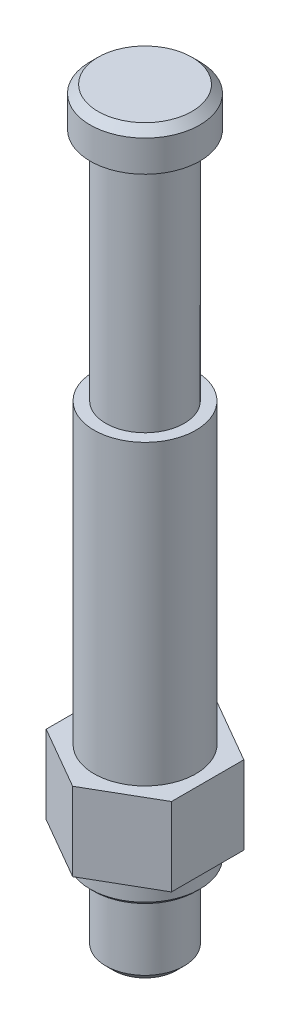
ISO-10303-21;
HEADER;
FILE_DESCRIPTION(('STEP AP214'),'2;1');
FILE_NAME('part.step','',(''),(''),'','','');
FILE_SCHEMA(('AUTOMOTIVE_DESIGN { 1 0 10303 214 1 1 1 1 }'));
ENDSEC;
DATA;
#1=APPLICATION_CONTEXT('core data for automotive mechanical design processes');
#2=APPLICATION_PROTOCOL_DEFINITION('international standard','automotive_design',2000,#1);
#3=PRODUCT_CONTEXT('',#1,'mechanical');
#4=PRODUCT('Part','Part','',(#3));
#5=PRODUCT_RELATED_PRODUCT_CATEGORY('part','',(#4));
#6=PRODUCT_DEFINITION_FORMATION('','',#4);
#7=PRODUCT_DEFINITION_CONTEXT('part definition',#1,'design');
#8=PRODUCT_DEFINITION('design','',#6,#7);
#9=PRODUCT_DEFINITION_SHAPE('','',#8);
#10=(LENGTH_UNIT() NAMED_UNIT(*) SI_UNIT(.MILLI.,.METRE.));
#11=(NAMED_UNIT(*) PLANE_ANGLE_UNIT() SI_UNIT($,.RADIAN.));
#12=(NAMED_UNIT(*) SI_UNIT($,.STERADIAN.) SOLID_ANGLE_UNIT());
#13=UNCERTAINTY_MEASURE_WITH_UNIT(LENGTH_MEASURE(1.E-05),#10,'distance_accuracy_value','');
#14=(GEOMETRIC_REPRESENTATION_CONTEXT(3) GLOBAL_UNCERTAINTY_ASSIGNED_CONTEXT((#13)) GLOBAL_UNIT_ASSIGNED_CONTEXT((#10,
#11,#12)) REPRESENTATION_CONTEXT('',''));
#15=CARTESIAN_POINT('',(0.,0.,0.));
#16=DIRECTION('',(0.,0.,1.));
#17=DIRECTION('',(1.,0.,0.));
#18=AXIS2_PLACEMENT_3D('',#15,#16,#17);
#19=CARTESIAN_POINT('',(0.,96.,0.));
#20=DIRECTION('',(0.,-1.,0.));
#21=DIRECTION('',(0.,0.,-1.));
#22=AXIS2_PLACEMENT_3D('',#19,#20,#21);
#23=PLANE('',#22);
#24=CARTESIAN_POINT('',(0.,96.,0.));
#25=DIRECTION('',(0.,-1.,0.));
#26=DIRECTION('',(0.,0.,-1.));
#27=AXIS2_PLACEMENT_3D('',#24,#25,#26);
#28=CIRCLE('',#27,6.);
#29=CARTESIAN_POINT('',(0.,96.,-6.));
#30=VERTEX_POINT('',#29);
#31=EDGE_CURVE('E150',#30,#30,#28,.F.);
#32=ORIENTED_EDGE('',*,*,#31,.T.);
#33=EDGE_LOOP('',(#32));
#34=FACE_BOUND('',#33,.T.);
#35=ADVANCED_FACE('F35',(#34),#23,.F.);
#36=CARTESIAN_POINT('',(0.,0.,0.));
#37=DIRECTION('',(0.,-1.,0.));
#38=DIRECTION('',(0.,0.,-1.));
#39=AXIS2_PLACEMENT_3D('',#36,#37,#38);
#40=CYLINDRICAL_SURFACE('',#39,7.);
#41=CARTESIAN_POINT('',(0.,95.,0.));
#42=DIRECTION('',(0.,-1.,0.));
#43=DIRECTION('',(0.,0.,-1.));
#44=AXIS2_PLACEMENT_3D('',#41,#42,#43);
#45=CIRCLE('',#44,7.);
#46=CARTESIAN_POINT('',(0.,95.,-7.));
#47=VERTEX_POINT('',#46);
#48=EDGE_CURVE('E147',#47,#47,#45,.T.);
#49=ORIENTED_EDGE('',*,*,#48,.T.);
#50=EDGE_LOOP('',(#49));
#51=FACE_BOUND('',#50,.T.);
#52=CARTESIAN_POINT('',(0.,91.,0.));
#53=DIRECTION('',(0.,-1.,0.));
#54=DIRECTION('',(0.,0.,-1.));
#55=AXIS2_PLACEMENT_3D('',#52,#53,#54);
#56=CIRCLE('',#55,7.);
#57=CARTESIAN_POINT('',(0.,91.,-7.));
#58=VERTEX_POINT('',#57);
#59=EDGE_CURVE('E138',#58,#58,#56,.T.);
#60=ORIENTED_EDGE('',*,*,#59,.F.);
#61=EDGE_LOOP('',(#60));
#62=FACE_BOUND('',#61,.T.);
#63=ADVANCED_FACE('F201',(#51,#62),#40,.T.);
#64=CARTESIAN_POINT('',(-7.,91.,0.));
#65=DIRECTION('',(0.,1.,0.));
#66=DIRECTION('',(0.,0.,1.));
#67=AXIS2_PLACEMENT_3D('',#64,#65,#66);
#68=PLANE('',#67);
#69=CARTESIAN_POINT('',(0.,91.,0.));
#70=DIRECTION('',(0.,-1.,0.));
#71=DIRECTION('',(0.,0.,-1.));
#72=AXIS2_PLACEMENT_3D('',#69,#70,#71);
#73=CIRCLE('',#72,5.);
#74=CARTESIAN_POINT('',(0.,91.,-5.));
#75=VERTEX_POINT('',#74);
#76=EDGE_CURVE('E135',#75,#75,#73,.T.);
#77=ORIENTED_EDGE('',*,*,#76,.F.);
#78=EDGE_LOOP('',(#77));
#79=FACE_BOUND('',#78,.T.);
#80=ORIENTED_EDGE('',*,*,#59,.T.);
#81=EDGE_LOOP('',(#80));
#82=FACE_BOUND('',#81,.T.);
#83=ADVANCED_FACE('F207',(#79,#82),#68,.F.);
#84=CARTESIAN_POINT('',(0.,0.,0.));
#85=DIRECTION('',(0.,-1.,0.));
#86=DIRECTION('',(0.,0.,-1.));
#87=AXIS2_PLACEMENT_3D('',#84,#85,#86);
#88=CYLINDRICAL_SURFACE('',#87,5.);
#89=CARTESIAN_POINT('',(0.,61.,0.));
#90=DIRECTION('',(0.,-1.,0.));
#91=DIRECTION('',(0.,0.,-1.));
#92=AXIS2_PLACEMENT_3D('',#89,#90,#91);
#93=CIRCLE('',#92,5.);
#94=CARTESIAN_POINT('',(0.,61.,-5.));
#95=VERTEX_POINT('',#94);
#96=EDGE_CURVE('E132',#95,#95,#93,.T.);
#97=ORIENTED_EDGE('',*,*,#96,.F.);
#98=EDGE_LOOP('',(#97));
#99=FACE_BOUND('',#98,.T.);
#100=ORIENTED_EDGE('',*,*,#76,.T.);
#101=EDGE_LOOP('',(#100));
#102=FACE_BOUND('',#101,.T.);
#103=ADVANCED_FACE('F227',(#99,#102),#88,.T.);
#104=CARTESIAN_POINT('',(-5.,61.,0.));
#105=DIRECTION('',(0.,-1.,0.));
#106=DIRECTION('',(0.,0.,-1.));
#107=AXIS2_PLACEMENT_3D('',#104,#105,#106);
#108=PLANE('',#107);
#109=CARTESIAN_POINT('',(0.,61.,0.));
#110=DIRECTION('',(0.,-1.,0.));
#111=DIRECTION('',(0.,0.,-1.));
#112=AXIS2_PLACEMENT_3D('',#109,#110,#111);
#113=CIRCLE('',#112,6.5);
#114=CARTESIAN_POINT('',(0.,61.,-6.5));
#115=VERTEX_POINT('',#114);
#116=EDGE_CURVE('E129',#115,#115,#113,.T.);
#117=ORIENTED_EDGE('',*,*,#116,.F.);
#118=EDGE_LOOP('',(#117));
#119=FACE_BOUND('',#118,.T.);
#120=ORIENTED_EDGE('',*,*,#96,.T.);
#121=EDGE_LOOP('',(#120));
#122=FACE_BOUND('',#121,.T.);
#123=ADVANCED_FACE('F232',(#119,#122),#108,.F.);
#124=CARTESIAN_POINT('',(0.,0.,0.));
#125=DIRECTION('',(0.,-1.,0.));
#126=DIRECTION('',(0.,0.,-1.));
#127=AXIS2_PLACEMENT_3D('',#124,#125,#126);
#128=CYLINDRICAL_SURFACE('',#127,6.5);
#129=CARTESIAN_POINT('',(0.,23.,0.));
#130=DIRECTION('',(0.,-1.,0.));
#131=DIRECTION('',(0.,0.,-1.));
#132=AXIS2_PLACEMENT_3D('',#129,#130,#131);
#133=CIRCLE('',#132,6.49999999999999);
#134=CARTESIAN_POINT('',(0.,23.,-6.49999999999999));
#135=VERTEX_POINT('',#134);
#136=EDGE_CURVE('E126',#135,#135,#133,.T.);
#137=ORIENTED_EDGE('',*,*,#136,.F.);
#138=EDGE_LOOP('',(#137));
#139=FACE_BOUND('',#138,.T.);
#140=ORIENTED_EDGE('',*,*,#116,.T.);
#141=EDGE_LOOP('',(#140));
#142=FACE_BOUND('',#141,.T.);
#143=ADVANCED_FACE('F239',(#139,#142),#128,.T.);
#144=CARTESIAN_POINT('',(-6.49999999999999,23.,0.));
#145=DIRECTION('',(0.,-1.,0.));
#146=DIRECTION('',(0.,0.,-1.));
#147=AXIS2_PLACEMENT_3D('',#144,#145,#146);
#148=PLANE('',#147);
#149=DIRECTION('',(-0.866025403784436,0.,-0.500000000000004));
#150=VECTOR('',#149,1.);
#151=CARTESIAN_POINT('',(-0.874999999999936,23.,-9.74278579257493));
#152=LINE('',#151,#150);
#153=CARTESIAN_POINT('',(8.,23.,-4.61880215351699));
#154=VERTEX_POINT('',#153);
#155=CARTESIAN_POINT('',(0.,23.,-9.23760430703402));
#156=VERTEX_POINT('',#155);
#157=EDGE_CURVE('E116',#154,#156,#152,.T.);
#158=ORIENTED_EDGE('',*,*,#157,.T.);
#159=DIRECTION('',(-0.86602540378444,0.,0.499999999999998));
#160=VECTOR('',#159,1.);
#161=CARTESIAN_POINT('',(-8.87499999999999,23.,-4.11362066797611));
#162=LINE('',#161,#160);
#163=CARTESIAN_POINT('',(-8.,23.,-4.61880215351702));
#164=VERTEX_POINT('',#163);
#165=EDGE_CURVE('E109',#156,#164,#162,.T.);
#166=ORIENTED_EDGE('',*,*,#165,.T.);
#167=DIRECTION('',(0.,0.,1.));
#168=VECTOR('',#167,1.);
#169=CARTESIAN_POINT('',(-8.,23.,0.));
#170=LINE('',#169,#168);
#171=CARTESIAN_POINT('',(-8.,23.,4.61880215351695));
#172=VERTEX_POINT('',#171);
#173=EDGE_CURVE('E93',#164,#172,#170,.T.);
#174=ORIENTED_EDGE('',*,*,#173,.T.);
#175=DIRECTION('',(0.866025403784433,0.,0.50000000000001));
#176=VECTOR('',#175,1.);
#177=CARTESIAN_POINT('',(-8.87500000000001,23.,4.113620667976));
#178=LINE('',#177,#176);
#179=CARTESIAN_POINT('',(0.,23.,9.23760430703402));
#180=VERTEX_POINT('',#179);
#181=EDGE_CURVE('E50',#172,#180,#178,.T.);
#182=ORIENTED_EDGE('',*,*,#181,.T.);
#183=DIRECTION('',(0.866025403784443,0.,-0.499999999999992));
#184=VECTOR('',#183,1.);
#185=CARTESIAN_POINT('',(-0.875000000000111,23.,9.74278579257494));
#186=LINE('',#185,#184);
#187=CARTESIAN_POINT('',(8.,23.,4.61880215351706));
#188=VERTEX_POINT('',#187);
#189=EDGE_CURVE('E87',#180,#188,#186,.T.);
#190=ORIENTED_EDGE('',*,*,#189,.T.);
#191=DIRECTION('',(0.,0.,-1.));
#192=VECTOR('',#191,1.);
#193=CARTESIAN_POINT('',(8.,23.,0.));
#194=LINE('',#193,#192);
#195=EDGE_CURVE('E94',#188,#154,#194,.T.);
#196=ORIENTED_EDGE('',*,*,#195,.T.);
#197=EDGE_LOOP('',(#158,#166,#174,#182,#190,#196));
#198=FACE_BOUND('',#197,.T.);
#199=ORIENTED_EDGE('',*,*,#136,.T.);
#200=EDGE_LOOP('',(#199));
#201=FACE_BOUND('',#200,.T.);
#202=ADVANCED_FACE('F102',(#198,#201),#148,.F.);
#203=CARTESIAN_POINT('',(-10.,13.,0.));
#204=DIRECTION('',(0.,1.,0.));
#205=DIRECTION('',(0.,0.,1.));
#206=AXIS2_PLACEMENT_3D('',#203,#204,#205);
#207=PLANE('',#206);
#208=DIRECTION('',(0.,0.,-1.));
#209=VECTOR('',#208,1.);
#210=CARTESIAN_POINT('',(-8.,13.,0.));
#211=LINE('',#210,#209);
#212=CARTESIAN_POINT('',(-8.,13.,4.61880215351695));
#213=VERTEX_POINT('',#212);
#214=CARTESIAN_POINT('',(-8.,13.,-4.61880215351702));
#215=VERTEX_POINT('',#214);
#216=EDGE_CURVE('E159',#213,#215,#211,.T.);
#217=ORIENTED_EDGE('',*,*,#216,.T.);
#218=DIRECTION('',(0.86602540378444,0.,-0.499999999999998));
#219=VECTOR('',#218,1.);
#220=CARTESIAN_POINT('',(-11.5,13.,-2.59807621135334));
#221=LINE('',#220,#219);
#222=CARTESIAN_POINT('',(0.,13.,-9.23760430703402));
#223=VERTEX_POINT('',#222);
#224=EDGE_CURVE('E106',#215,#223,#221,.T.);
#225=ORIENTED_EDGE('',*,*,#224,.T.);
#226=DIRECTION('',(0.866025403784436,0.,0.500000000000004));
#227=VECTOR('',#226,1.);
#228=CARTESIAN_POINT('',(-3.49999999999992,13.,-11.2583302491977));
#229=LINE('',#228,#227);
#230=CARTESIAN_POINT('',(8.,13.,-4.61880215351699));
#231=VERTEX_POINT('',#230);
#232=EDGE_CURVE('E167',#223,#231,#229,.T.);
#233=ORIENTED_EDGE('',*,*,#232,.T.);
#234=DIRECTION('',(0.,0.,1.));
#235=VECTOR('',#234,1.);
#236=CARTESIAN_POINT('',(8.,13.,0.));
#237=LINE('',#236,#235);
#238=CARTESIAN_POINT('',(8.,13.,4.61880215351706));
#239=VERTEX_POINT('',#238);
#240=EDGE_CURVE('E43',#231,#239,#237,.T.);
#241=ORIENTED_EDGE('',*,*,#240,.T.);
#242=DIRECTION('',(-0.866025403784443,0.,0.499999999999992));
#243=VECTOR('',#242,1.);
#244=CARTESIAN_POINT('',(-3.50000000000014,13.,11.2583302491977));
#245=LINE('',#244,#243);
#246=CARTESIAN_POINT('',(0.,13.,9.23760430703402));
#247=VERTEX_POINT('',#246);
#248=EDGE_CURVE('E11',#239,#247,#245,.T.);
#249=ORIENTED_EDGE('',*,*,#248,.T.);
#250=DIRECTION('',(-0.866025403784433,0.,-0.50000000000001));
#251=VECTOR('',#250,1.);
#252=CARTESIAN_POINT('',(-11.5,13.,2.59807621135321));
#253=LINE('',#252,#251);
#254=EDGE_CURVE('E98',#247,#213,#253,.T.);
#255=ORIENTED_EDGE('',*,*,#254,.T.);
#256=EDGE_LOOP('',(#217,#225,#233,#241,#249,#255));
#257=FACE_BOUND('',#256,.T.);
#258=CARTESIAN_POINT('',(0.,13.,0.));
#259=DIRECTION('',(0.,-1.,0.));
#260=DIRECTION('',(0.,0.,-1.));
#261=AXIS2_PLACEMENT_3D('',#258,#259,#260);
#262=CIRCLE('',#261,7.);
#263=CARTESIAN_POINT('',(0.,13.,-7.));
#264=VERTEX_POINT('',#263);
#265=EDGE_CURVE('E123',#264,#264,#262,.T.);
#266=ORIENTED_EDGE('',*,*,#265,.F.);
#267=EDGE_LOOP('',(#266));
#268=FACE_BOUND('',#267,.T.);
#269=ADVANCED_FACE('F171',(#257,#268),#207,.F.);
#270=CARTESIAN_POINT('',(0.,0.,0.));
#271=DIRECTION('',(0.,-1.,0.));
#272=DIRECTION('',(0.,0.,-1.));
#273=AXIS2_PLACEMENT_3D('',#270,#271,#272);
#274=CYLINDRICAL_SURFACE('',#273,7.);
#275=CARTESIAN_POINT('',(0.,10.5,0.));
#276=DIRECTION('',(0.,1.,0.));
#277=DIRECTION('',(0.,0.,1.));
#278=AXIS2_PLACEMENT_3D('',#275,#276,#277);
#279=CIRCLE('',#278,7.);
#280=CARTESIAN_POINT('',(0.,10.5,7.));
#281=VERTEX_POINT('',#280);
#282=EDGE_CURVE('E156',#281,#281,#279,.T.);
#283=ORIENTED_EDGE('',*,*,#282,.T.);
#284=EDGE_LOOP('',(#283));
#285=FACE_BOUND('',#284,.T.);
#286=ORIENTED_EDGE('',*,*,#265,.T.);
#287=EDGE_LOOP('',(#286));
#288=FACE_BOUND('',#287,.T.);
#289=ADVANCED_FACE('F248',(#285,#288),#274,.T.);
#290=CARTESIAN_POINT('',(-7.,10.,0.));
#291=DIRECTION('',(0.,1.,0.));
#292=DIRECTION('',(0.,0.,1.));
#293=AXIS2_PLACEMENT_3D('',#290,#291,#292);
#294=PLANE('',#293);
#295=CARTESIAN_POINT('',(0.,10.,0.));
#296=DIRECTION('',(0.,1.,0.));
#297=DIRECTION('',(0.,0.,1.));
#298=AXIS2_PLACEMENT_3D('',#295,#296,#297);
#299=CIRCLE('',#298,6.50000000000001);
#300=CARTESIAN_POINT('',(0.,10.,6.50000000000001));
#301=VERTEX_POINT('',#300);
#302=EDGE_CURVE('E153',#301,#301,#299,.F.);
#303=ORIENTED_EDGE('',*,*,#302,.T.);
#304=EDGE_LOOP('',(#303));
#305=FACE_BOUND('',#304,.T.);
#306=CARTESIAN_POINT('',(0.,10.,0.));
#307=DIRECTION('',(0.,-1.,0.));
#308=DIRECTION('',(0.,0.,-1.));
#309=AXIS2_PLACEMENT_3D('',#306,#307,#308);
#310=CIRCLE('',#309,5.);
#311=CARTESIAN_POINT('',(0.,10.,-5.));
#312=VERTEX_POINT('',#311);
#313=EDGE_CURVE('E120',#312,#312,#310,.T.);
#314=ORIENTED_EDGE('',*,*,#313,.F.);
#315=EDGE_LOOP('',(#314));
#316=FACE_BOUND('',#315,.T.);
#317=ADVANCED_FACE('F251',(#305,#316),#294,.F.);
#318=CARTESIAN_POINT('',(0.,0.,0.));
#319=DIRECTION('',(0.,-1.,0.));
#320=DIRECTION('',(0.,0.,-1.));
#321=AXIS2_PLACEMENT_3D('',#318,#319,#320);
#322=CYLINDRICAL_SURFACE('',#321,5.);
#323=CARTESIAN_POINT('',(0.,1.00000000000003,0.));
#324=DIRECTION('',(0.,1.,0.));
#325=DIRECTION('',(0.,0.,1.));
#326=AXIS2_PLACEMENT_3D('',#323,#324,#325);
#327=CIRCLE('',#326,5.);
#328=CARTESIAN_POINT('',(0.,1.00000000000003,5.));
#329=VERTEX_POINT('',#328);
#330=EDGE_CURVE('E144',#329,#329,#327,.T.);
#331=ORIENTED_EDGE('',*,*,#330,.T.);
#332=EDGE_LOOP('',(#331));
#333=FACE_BOUND('',#332,.T.);
#334=ORIENTED_EDGE('',*,*,#313,.T.);
#335=EDGE_LOOP('',(#334));
#336=FACE_BOUND('',#335,.T.);
#337=ADVANCED_FACE('F255',(#333,#336),#322,.T.);
#338=CARTESIAN_POINT('',(-5.,0.,0.));
#339=DIRECTION('',(0.,1.,0.));
#340=DIRECTION('',(0.,0.,1.));
#341=AXIS2_PLACEMENT_3D('',#338,#339,#340);
#342=PLANE('',#341);
#343=CARTESIAN_POINT('',(0.,0.,0.));
#344=DIRECTION('',(0.,1.,0.));
#345=DIRECTION('',(0.,0.,1.));
#346=AXIS2_PLACEMENT_3D('',#343,#344,#345);
#347=CIRCLE('',#346,3.99999999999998);
#348=CARTESIAN_POINT('',(0.,0.,3.99999999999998));
#349=VERTEX_POINT('',#348);
#350=EDGE_CURVE('E141',#349,#349,#347,.F.);
#351=ORIENTED_EDGE('',*,*,#350,.T.);
#352=EDGE_LOOP('',(#351));
#353=FACE_BOUND('',#352,.T.);
#354=ADVANCED_FACE('F214',(#353),#342,.F.);
#355=CARTESIAN_POINT('',(0.,0.,0.));
#356=DIRECTION('',(0.,1.,0.));
#357=DIRECTION('',(0.,0.,1.));
#358=AXIS2_PLACEMENT_3D('',#355,#356,#357);
#359=CONICAL_SURFACE('',#358,3.99999999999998,0.785398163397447);
#360=ORIENTED_EDGE('',*,*,#330,.F.);
#361=EDGE_LOOP('',(#360));
#362=FACE_BOUND('',#361,.T.);
#363=ORIENTED_EDGE('',*,*,#350,.F.);
#364=EDGE_LOOP('',(#363));
#365=FACE_BOUND('',#364,.T.);
#366=ADVANCED_FACE('F212',(#362,#365),#359,.T.);
#367=CARTESIAN_POINT('',(0.,95.,0.));
#368=DIRECTION('',(0.,-1.,0.));
#369=DIRECTION('',(0.,0.,-1.));
#370=AXIS2_PLACEMENT_3D('',#367,#368,#369);
#371=CONICAL_SURFACE('',#370,7.,0.785398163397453);
#372=ORIENTED_EDGE('',*,*,#31,.F.);
#373=EDGE_LOOP('',(#372));
#374=FACE_BOUND('',#373,.T.);
#375=ORIENTED_EDGE('',*,*,#48,.F.);
#376=EDGE_LOOP('',(#375));
#377=FACE_BOUND('',#376,.T.);
#378=ADVANCED_FACE('F196',(#374,#377),#371,.T.);
#379=CARTESIAN_POINT('',(0.,10.,0.));
#380=DIRECTION('',(0.,1.,0.));
#381=DIRECTION('',(0.,0.,1.));
#382=AXIS2_PLACEMENT_3D('',#379,#380,#381);
#383=CONICAL_SURFACE('',#382,6.50000000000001,0.785398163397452);
#384=ORIENTED_EDGE('',*,*,#282,.F.);
#385=EDGE_LOOP('',(#384));
#386=FACE_BOUND('',#385,.T.);
#387=ORIENTED_EDGE('',*,*,#302,.F.);
#388=EDGE_LOOP('',(#387));
#389=FACE_BOUND('',#388,.T.);
#390=ADVANCED_FACE('F37',(#386,#389),#383,.T.);
#391=CARTESIAN_POINT('',(-8.,33.9017148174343,-10.));
#392=DIRECTION('',(1.,0.,0.));
#393=DIRECTION('',(0.,0.,-1.));
#394=AXIS2_PLACEMENT_3D('',#391,#392,#393);
#395=PLANE('',#394);
#396=ORIENTED_EDGE('',*,*,#173,.F.);
#397=DIRECTION('',(0.,-1.,0.));
#398=VECTOR('',#397,1.);
#399=CARTESIAN_POINT('',(-8.,33.9017148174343,-4.61880215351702));
#400=LINE('',#399,#398);
#401=EDGE_CURVE('E164',#164,#215,#400,.T.);
#402=ORIENTED_EDGE('',*,*,#401,.T.);
#403=ORIENTED_EDGE('',*,*,#216,.F.);
#404=DIRECTION('',(0.,1.,0.));
#405=VECTOR('',#404,1.);
#406=CARTESIAN_POINT('',(-8.,33.9017148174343,4.61880215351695));
#407=LINE('',#406,#405);
#408=EDGE_CURVE('E162',#213,#172,#407,.T.);
#409=ORIENTED_EDGE('',*,*,#408,.T.);
#410=EDGE_LOOP('',(#396,#402,#403,#409));
#411=FACE_BOUND('',#410,.T.);
#412=ADVANCED_FACE('F188',(#411),#395,.F.);
#413=CARTESIAN_POINT('',(-6.33012701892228,33.9017148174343,12.8923048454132));
#414=DIRECTION('',(-0.499999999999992,0.,-0.866025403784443));
#415=DIRECTION('',(-0.866025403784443,0.,0.499999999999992));
#416=AXIS2_PLACEMENT_3D('',#413,#414,#415);
#417=PLANE('',#416);
#418=DIRECTION('',(0.,-1.,0.));
#419=VECTOR('',#418,1.);
#420=CARTESIAN_POINT('',(0.,33.9017148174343,9.23760430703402));
#421=LINE('',#420,#419);
#422=EDGE_CURVE('E89',#180,#247,#421,.T.);
#423=ORIENTED_EDGE('',*,*,#422,.T.);
#424=ORIENTED_EDGE('',*,*,#248,.F.);
#425=DIRECTION('',(0.,-1.,0.));
#426=VECTOR('',#425,1.);
#427=CARTESIAN_POINT('',(8.,33.9017148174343,4.61880215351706));
#428=LINE('',#427,#426);
#429=EDGE_CURVE('E90',#188,#239,#428,.T.);
#430=ORIENTED_EDGE('',*,*,#429,.F.);
#431=ORIENTED_EDGE('',*,*,#189,.F.);
#432=EDGE_LOOP('',(#423,#424,#430,#431));
#433=FACE_BOUND('',#432,.T.);
#434=ADVANCED_FACE('F88',(#433),#417,.F.);
#435=CARTESIAN_POINT('',(8.,33.9017148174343,10.));
#436=DIRECTION('',(-1.,0.,0.));
#437=DIRECTION('',(0.,0.,1.));
#438=AXIS2_PLACEMENT_3D('',#435,#436,#437);
#439=PLANE('',#438);
#440=ORIENTED_EDGE('',*,*,#429,.T.);
#441=ORIENTED_EDGE('',*,*,#240,.F.);
#442=DIRECTION('',(0.,-1.,0.));
#443=VECTOR('',#442,1.);
#444=CARTESIAN_POINT('',(8.,33.9017148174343,-4.61880215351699));
#445=LINE('',#444,#443);
#446=EDGE_CURVE('E177',#154,#231,#445,.T.);
#447=ORIENTED_EDGE('',*,*,#446,.F.);
#448=ORIENTED_EDGE('',*,*,#195,.F.);
#449=EDGE_LOOP('',(#440,#441,#447,#448));
#450=FACE_BOUND('',#449,.T.);
#451=ADVANCED_FACE('F176',(#450),#439,.F.);
#452=CARTESIAN_POINT('',(15.8301270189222,33.9017148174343,-0.0980762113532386));
#453=DIRECTION('',(-0.500000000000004,0.,0.866025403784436));
#454=DIRECTION('',(0.866025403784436,0.,0.500000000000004));
#455=AXIS2_PLACEMENT_3D('',#452,#453,#454);
#456=PLANE('',#455);
#457=ORIENTED_EDGE('',*,*,#446,.T.);
#458=ORIENTED_EDGE('',*,*,#232,.F.);
#459=DIRECTION('',(0.,-1.,0.));
#460=VECTOR('',#459,1.);
#461=CARTESIAN_POINT('',(0.,33.9017148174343,-9.23760430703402));
#462=LINE('',#461,#460);
#463=EDGE_CURVE('E111',#156,#223,#462,.T.);
#464=ORIENTED_EDGE('',*,*,#463,.F.);
#465=ORIENTED_EDGE('',*,*,#157,.F.);
#466=EDGE_LOOP('',(#457,#458,#464,#465));
#467=FACE_BOUND('',#466,.T.);
#468=ADVANCED_FACE('F179',(#467),#456,.F.);
#469=CARTESIAN_POINT('',(7.83012701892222,33.9017148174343,-13.7583302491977));
#470=DIRECTION('',(0.499999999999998,0.,0.86602540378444));
#471=DIRECTION('',(0.86602540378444,0.,-0.499999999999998));
#472=AXIS2_PLACEMENT_3D('',#469,#470,#471);
#473=PLANE('',#472);
#474=ORIENTED_EDGE('',*,*,#463,.T.);
#475=ORIENTED_EDGE('',*,*,#224,.F.);
#476=ORIENTED_EDGE('',*,*,#401,.F.);
#477=ORIENTED_EDGE('',*,*,#165,.F.);
#478=EDGE_LOOP('',(#474,#475,#476,#477));
#479=FACE_BOUND('',#478,.T.);
#480=ADVANCED_FACE('F185',(#479),#473,.F.);
#481=CARTESIAN_POINT('',(-14.3301270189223,33.9017148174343,0.964101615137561));
#482=DIRECTION('',(0.50000000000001,0.,-0.866025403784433));
#483=DIRECTION('',(-0.866025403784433,0.,-0.50000000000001));
#484=AXIS2_PLACEMENT_3D('',#481,#482,#483);
#485=PLANE('',#484);
#486=ORIENTED_EDGE('',*,*,#408,.F.);
#487=ORIENTED_EDGE('',*,*,#254,.F.);
#488=ORIENTED_EDGE('',*,*,#422,.F.);
#489=ORIENTED_EDGE('',*,*,#181,.F.);
#490=EDGE_LOOP('',(#486,#487,#488,#489));
#491=FACE_BOUND('',#490,.T.);
#492=ADVANCED_FACE('F96',(#491),#485,.F.);
#493=CLOSED_SHELL('',(#35,#63,#83,#103,#123,#143,#202,#269,#289,#317,#337,#354,#366,#378,#390,
#412,#434,#451,#468,#480,#492));
#494=MANIFOLD_SOLID_BREP('B2',#493);
#495=ADVANCED_BREP_SHAPE_REPRESENTATION('',(#18,#494),#14);
#496=SHAPE_DEFINITION_REPRESENTATION(#9,#495);
ENDSEC;
END-ISO-10303-21;
